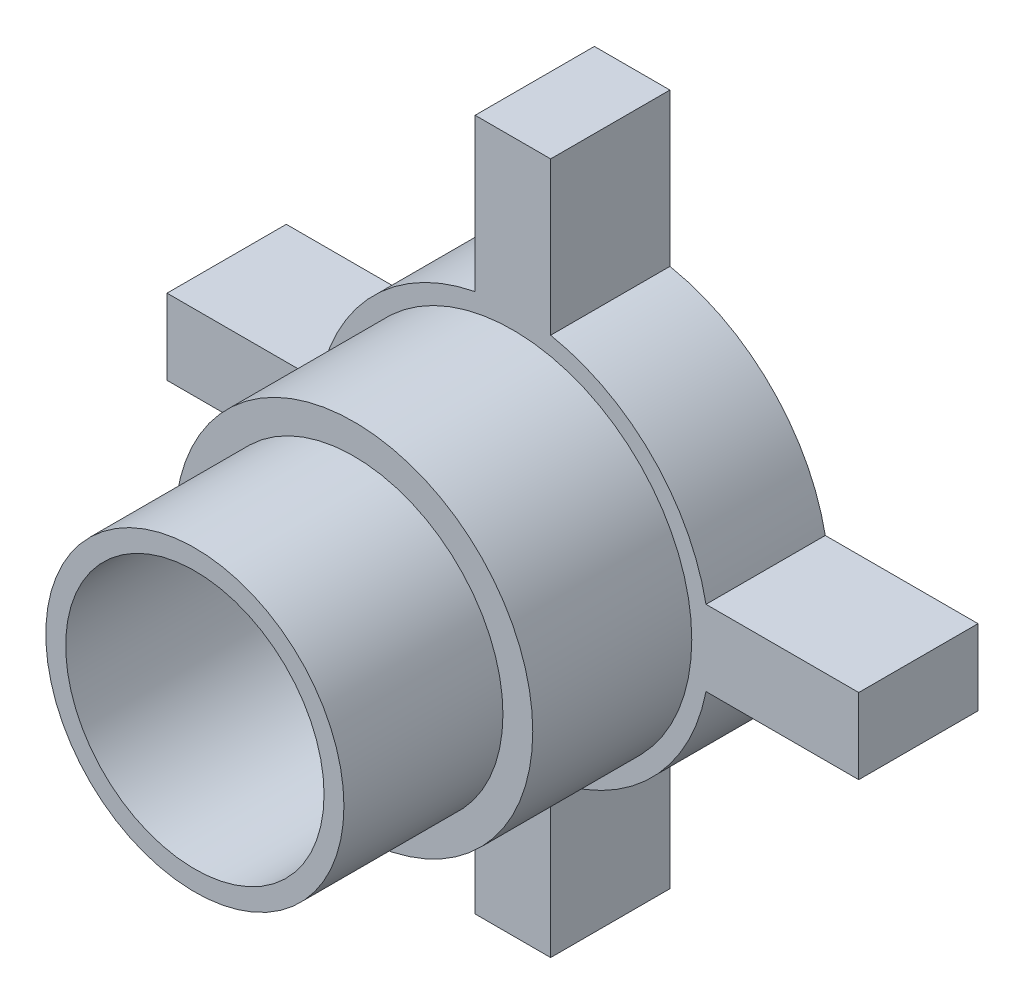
ISO-10303-21;
HEADER;
FILE_DESCRIPTION(('STEP AP214'),'2;1');
FILE_NAME('part.step','',(''),(''),'','','');
FILE_SCHEMA(('AUTOMOTIVE_DESIGN { 1 0 10303 214 1 1 1 1 }'));
ENDSEC;
DATA;
#1=APPLICATION_CONTEXT('core data for automotive mechanical design processes');
#2=APPLICATION_PROTOCOL_DEFINITION('international standard','automotive_design',2000,#1);
#3=PRODUCT_CONTEXT('',#1,'mechanical');
#4=PRODUCT('Part','Part','',(#3));
#5=PRODUCT_RELATED_PRODUCT_CATEGORY('part','',(#4));
#6=PRODUCT_DEFINITION_FORMATION('','',#4);
#7=PRODUCT_DEFINITION_CONTEXT('part definition',#1,'design');
#8=PRODUCT_DEFINITION('design','',#6,#7);
#9=PRODUCT_DEFINITION_SHAPE('','',#8);
#10=(LENGTH_UNIT() NAMED_UNIT(*) SI_UNIT(.MILLI.,.METRE.));
#11=(NAMED_UNIT(*) PLANE_ANGLE_UNIT() SI_UNIT($,.RADIAN.));
#12=(NAMED_UNIT(*) SI_UNIT($,.STERADIAN.) SOLID_ANGLE_UNIT());
#13=UNCERTAINTY_MEASURE_WITH_UNIT(LENGTH_MEASURE(1.E-05),#10,'distance_accuracy_value','');
#14=(GEOMETRIC_REPRESENTATION_CONTEXT(3) GLOBAL_UNCERTAINTY_ASSIGNED_CONTEXT((#13)) GLOBAL_UNIT_ASSIGNED_CONTEXT((#10,
#11,#12)) REPRESENTATION_CONTEXT('',''));
#15=CARTESIAN_POINT('',(0.,0.,0.));
#16=DIRECTION('',(0.,0.,1.));
#17=DIRECTION('',(1.,0.,0.));
#18=AXIS2_PLACEMENT_3D('',#15,#16,#17);
#19=CARTESIAN_POINT('',(1.9,9.7159662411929,6.));
#20=DIRECTION('',(-1.,0.,0.));
#21=DIRECTION('',(0.,0.,1.));
#22=AXIS2_PLACEMENT_3D('',#19,#20,#21);
#23=PLANE('',#22);
#24=DIRECTION('',(0.,1.,0.));
#25=VECTOR('',#24,1.);
#26=CARTESIAN_POINT('',(1.9,9.7159662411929,0.));
#27=LINE('',#26,#25);
#28=CARTESIAN_POINT('',(1.9,9.7159662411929,0.));
#29=VERTEX_POINT('',#28);
#30=CARTESIAN_POINT('',(1.9,17.4,0.));
#31=VERTEX_POINT('',#30);
#32=EDGE_CURVE('E185',#29,#31,#27,.T.);
#33=ORIENTED_EDGE('',*,*,#32,.T.);
#34=DIRECTION('',(0.,0.,-1.));
#35=VECTOR('',#34,1.);
#36=CARTESIAN_POINT('',(1.9,17.4,6.));
#37=LINE('',#36,#35);
#38=CARTESIAN_POINT('',(1.9,17.4,6.));
#39=VERTEX_POINT('',#38);
#40=EDGE_CURVE('E42',#39,#31,#37,.T.);
#41=ORIENTED_EDGE('',*,*,#40,.F.);
#42=DIRECTION('',(0.,1.,0.));
#43=VECTOR('',#42,1.);
#44=CARTESIAN_POINT('',(1.9,9.7159662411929,6.));
#45=LINE('',#44,#43);
#46=CARTESIAN_POINT('',(1.9,9.7159662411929,6.));
#47=VERTEX_POINT('',#46);
#48=EDGE_CURVE('E216',#47,#39,#45,.T.);
#49=ORIENTED_EDGE('',*,*,#48,.F.);
#50=DIRECTION('',(0.,0.,-1.));
#51=VECTOR('',#50,1.);
#52=CARTESIAN_POINT('',(1.9,9.7159662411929,6.));
#53=LINE('',#52,#51);
#54=EDGE_CURVE('E181',#47,#29,#53,.T.);
#55=ORIENTED_EDGE('',*,*,#54,.T.);
#56=EDGE_LOOP('',(#33,#41,#49,#55));
#57=FACE_BOUND('',#56,.T.);
#58=ADVANCED_FACE('F39',(#57),#23,.F.);
#59=CARTESIAN_POINT('',(-1.9,17.4,6.));
#60=DIRECTION('',(0.,-1.,0.));
#61=DIRECTION('',(0.,0.,-1.));
#62=AXIS2_PLACEMENT_3D('',#59,#60,#61);
#63=PLANE('',#62);
#64=DIRECTION('',(-1.,0.,0.));
#65=VECTOR('',#64,1.);
#66=CARTESIAN_POINT('',(-1.9,17.4,0.));
#67=LINE('',#66,#65);
#68=CARTESIAN_POINT('',(-1.9,17.4,0.));
#69=VERTEX_POINT('',#68);
#70=EDGE_CURVE('E188',#31,#69,#67,.T.);
#71=ORIENTED_EDGE('',*,*,#70,.T.);
#72=DIRECTION('',(0.,0.,-1.));
#73=VECTOR('',#72,1.);
#74=CARTESIAN_POINT('',(-1.9,17.4,6.));
#75=LINE('',#74,#73);
#76=CARTESIAN_POINT('',(-1.9,17.4,6.));
#77=VERTEX_POINT('',#76);
#78=EDGE_CURVE('E249',#77,#69,#75,.T.);
#79=ORIENTED_EDGE('',*,*,#78,.F.);
#80=DIRECTION('',(-1.,0.,0.));
#81=VECTOR('',#80,1.);
#82=CARTESIAN_POINT('',(-1.9,17.4,6.));
#83=LINE('',#82,#81);
#84=EDGE_CURVE('E124',#39,#77,#83,.T.);
#85=ORIENTED_EDGE('',*,*,#84,.F.);
#86=ORIENTED_EDGE('',*,*,#40,.T.);
#87=EDGE_LOOP('',(#71,#79,#85,#86));
#88=FACE_BOUND('',#87,.T.);
#89=ADVANCED_FACE('F255',(#88),#63,.F.);
#90=CARTESIAN_POINT('',(-1.9,9.7159662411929,6.));
#91=DIRECTION('',(1.,0.,0.));
#92=DIRECTION('',(0.,0.,-1.));
#93=AXIS2_PLACEMENT_3D('',#90,#91,#92);
#94=PLANE('',#93);
#95=DIRECTION('',(0.,-1.,0.));
#96=VECTOR('',#95,1.);
#97=CARTESIAN_POINT('',(-1.9,9.7159662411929,0.));
#98=LINE('',#97,#96);
#99=CARTESIAN_POINT('',(-1.9,9.7159662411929,0.));
#100=VERTEX_POINT('',#99);
#101=EDGE_CURVE('E191',#69,#100,#98,.T.);
#102=ORIENTED_EDGE('',*,*,#101,.T.);
#103=DIRECTION('',(0.,0.,-1.));
#104=VECTOR('',#103,1.);
#105=CARTESIAN_POINT('',(-1.9,9.7159662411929,6.));
#106=LINE('',#105,#104);
#107=CARTESIAN_POINT('',(-1.9,9.7159662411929,6.));
#108=VERTEX_POINT('',#107);
#109=EDGE_CURVE('E247',#108,#100,#106,.T.);
#110=ORIENTED_EDGE('',*,*,#109,.F.);
#111=DIRECTION('',(0.,-1.,0.));
#112=VECTOR('',#111,1.);
#113=CARTESIAN_POINT('',(-1.9,9.7159662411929,6.));
#114=LINE('',#113,#112);
#115=EDGE_CURVE('E272',#77,#108,#114,.T.);
#116=ORIENTED_EDGE('',*,*,#115,.F.);
#117=ORIENTED_EDGE('',*,*,#78,.T.);
#118=EDGE_LOOP('',(#102,#110,#116,#117));
#119=FACE_BOUND('',#118,.T.);
#120=ADVANCED_FACE('F264',(#119),#94,.F.);
#121=CARTESIAN_POINT('',(0.,0.,6.));
#122=DIRECTION('',(0.,0.,-1.));
#123=DIRECTION('',(-1.,0.,0.));
#124=AXIS2_PLACEMENT_3D('',#121,#122,#123);
#125=CYLINDRICAL_SURFACE('',#124,9.9);
#126=CARTESIAN_POINT('',(0.,0.,0.));
#127=DIRECTION('',(0.,0.,1.));
#128=DIRECTION('',(1.,0.,0.));
#129=AXIS2_PLACEMENT_3D('',#126,#127,#128);
#130=CIRCLE('',#129,9.9);
#131=CARTESIAN_POINT('',(-9.7159662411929,1.9,0.));
#132=VERTEX_POINT('',#131);
#133=EDGE_CURVE('E193',#100,#132,#130,.T.);
#134=ORIENTED_EDGE('',*,*,#133,.T.);
#135=DIRECTION('',(0.,0.,-1.));
#136=VECTOR('',#135,1.);
#137=CARTESIAN_POINT('',(-9.7159662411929,1.9,6.));
#138=LINE('',#137,#136);
#139=CARTESIAN_POINT('',(-9.7159662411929,1.9,6.));
#140=VERTEX_POINT('',#139);
#141=EDGE_CURVE('E244',#140,#132,#138,.T.);
#142=ORIENTED_EDGE('',*,*,#141,.F.);
#143=CARTESIAN_POINT('',(0.,0.,6.));
#144=DIRECTION('',(0.,0.,1.));
#145=DIRECTION('',(1.,0.,0.));
#146=AXIS2_PLACEMENT_3D('',#143,#144,#145);
#147=CIRCLE('',#146,9.9);
#148=EDGE_CURVE('E269',#108,#140,#147,.T.);
#149=ORIENTED_EDGE('',*,*,#148,.F.);
#150=ORIENTED_EDGE('',*,*,#109,.T.);
#151=EDGE_LOOP('',(#134,#142,#149,#150));
#152=FACE_BOUND('',#151,.T.);
#153=ADVANCED_FACE('F267',(#152),#125,.T.);
#154=CARTESIAN_POINT('',(-17.4,1.9,6.));
#155=DIRECTION('',(0.,-1.,0.));
#156=DIRECTION('',(1.,0.,0.));
#157=AXIS2_PLACEMENT_3D('',#154,#155,#156);
#158=PLANE('',#157);
#159=DIRECTION('',(-1.,0.,0.));
#160=VECTOR('',#159,1.);
#161=CARTESIAN_POINT('',(-17.4,1.9,0.));
#162=LINE('',#161,#160);
#163=CARTESIAN_POINT('',(-17.4,1.9,0.));
#164=VERTEX_POINT('',#163);
#165=EDGE_CURVE('E195',#132,#164,#162,.T.);
#166=ORIENTED_EDGE('',*,*,#165,.T.);
#167=DIRECTION('',(0.,0.,-1.));
#168=VECTOR('',#167,1.);
#169=CARTESIAN_POINT('',(-17.4,1.9,6.));
#170=LINE('',#169,#168);
#171=CARTESIAN_POINT('',(-17.4,1.9,6.));
#172=VERTEX_POINT('',#171);
#173=EDGE_CURVE('E241',#172,#164,#170,.T.);
#174=ORIENTED_EDGE('',*,*,#173,.F.);
#175=DIRECTION('',(-1.,0.,0.));
#176=VECTOR('',#175,1.);
#177=CARTESIAN_POINT('',(-17.4,1.9,6.));
#178=LINE('',#177,#176);
#179=EDGE_CURVE('E271',#140,#172,#178,.T.);
#180=ORIENTED_EDGE('',*,*,#179,.F.);
#181=ORIENTED_EDGE('',*,*,#141,.T.);
#182=EDGE_LOOP('',(#166,#174,#180,#181));
#183=FACE_BOUND('',#182,.T.);
#184=ADVANCED_FACE('F331',(#183),#158,.F.);
#185=CARTESIAN_POINT('',(-17.4,1.9,6.));
#186=DIRECTION('',(1.,0.,0.));
#187=DIRECTION('',(0.,0.,-1.));
#188=AXIS2_PLACEMENT_3D('',#185,#186,#187);
#189=PLANE('',#188);
#190=DIRECTION('',(0.,-1.,0.));
#191=VECTOR('',#190,1.);
#192=CARTESIAN_POINT('',(-17.4,1.9,0.));
#193=LINE('',#192,#191);
#194=CARTESIAN_POINT('',(-17.4,-1.9,0.));
#195=VERTEX_POINT('',#194);
#196=EDGE_CURVE('E197',#164,#195,#193,.T.);
#197=ORIENTED_EDGE('',*,*,#196,.T.);
#198=DIRECTION('',(0.,0.,-1.));
#199=VECTOR('',#198,1.);
#200=CARTESIAN_POINT('',(-17.4,-1.9,6.));
#201=LINE('',#200,#199);
#202=CARTESIAN_POINT('',(-17.4,-1.9,6.));
#203=VERTEX_POINT('',#202);
#204=EDGE_CURVE('E238',#203,#195,#201,.T.);
#205=ORIENTED_EDGE('',*,*,#204,.F.);
#206=DIRECTION('',(0.,-1.,0.));
#207=VECTOR('',#206,1.);
#208=CARTESIAN_POINT('',(-17.4,1.9,6.));
#209=LINE('',#208,#207);
#210=EDGE_CURVE('E274',#172,#203,#209,.T.);
#211=ORIENTED_EDGE('',*,*,#210,.F.);
#212=ORIENTED_EDGE('',*,*,#173,.T.);
#213=EDGE_LOOP('',(#197,#205,#211,#212));
#214=FACE_BOUND('',#213,.T.);
#215=ADVANCED_FACE('F328',(#214),#189,.F.);
#216=CARTESIAN_POINT('',(-17.4,-1.9,6.));
#217=DIRECTION('',(0.,1.,0.));
#218=DIRECTION('',(-1.,0.,0.));
#219=AXIS2_PLACEMENT_3D('',#216,#217,#218);
#220=PLANE('',#219);
#221=DIRECTION('',(1.,0.,0.));
#222=VECTOR('',#221,1.);
#223=CARTESIAN_POINT('',(-17.4,-1.9,0.));
#224=LINE('',#223,#222);
#225=CARTESIAN_POINT('',(-9.7159662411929,-1.9,0.));
#226=VERTEX_POINT('',#225);
#227=EDGE_CURVE('E199',#195,#226,#224,.T.);
#228=ORIENTED_EDGE('',*,*,#227,.T.);
#229=DIRECTION('',(0.,0.,-1.));
#230=VECTOR('',#229,1.);
#231=CARTESIAN_POINT('',(-9.7159662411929,-1.9,6.));
#232=LINE('',#231,#230);
#233=CARTESIAN_POINT('',(-9.7159662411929,-1.9,6.));
#234=VERTEX_POINT('',#233);
#235=EDGE_CURVE('E235',#234,#226,#232,.T.);
#236=ORIENTED_EDGE('',*,*,#235,.F.);
#237=DIRECTION('',(1.,0.,0.));
#238=VECTOR('',#237,1.);
#239=CARTESIAN_POINT('',(-17.4,-1.9,6.));
#240=LINE('',#239,#238);
#241=EDGE_CURVE('E280',#203,#234,#240,.T.);
#242=ORIENTED_EDGE('',*,*,#241,.F.);
#243=ORIENTED_EDGE('',*,*,#204,.T.);
#244=EDGE_LOOP('',(#228,#236,#242,#243));
#245=FACE_BOUND('',#244,.T.);
#246=ADVANCED_FACE('F324',(#245),#220,.F.);
#247=CARTESIAN_POINT('',(0.,0.,6.));
#248=DIRECTION('',(0.,0.,-1.));
#249=DIRECTION('',(-1.,0.,0.));
#250=AXIS2_PLACEMENT_3D('',#247,#248,#249);
#251=CYLINDRICAL_SURFACE('',#250,9.9);
#252=CARTESIAN_POINT('',(0.,0.,0.));
#253=DIRECTION('',(0.,0.,1.));
#254=DIRECTION('',(1.,0.,0.));
#255=AXIS2_PLACEMENT_3D('',#252,#253,#254);
#256=CIRCLE('',#255,9.9);
#257=CARTESIAN_POINT('',(-1.90000000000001,-9.71596624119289,0.));
#258=VERTEX_POINT('',#257);
#259=EDGE_CURVE('E201',#226,#258,#256,.T.);
#260=ORIENTED_EDGE('',*,*,#259,.T.);
#261=DIRECTION('',(0.,0.,-1.));
#262=VECTOR('',#261,1.);
#263=CARTESIAN_POINT('',(-1.90000000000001,-9.71596624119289,6.));
#264=LINE('',#263,#262);
#265=CARTESIAN_POINT('',(-1.90000000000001,-9.71596624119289,6.));
#266=VERTEX_POINT('',#265);
#267=EDGE_CURVE('E232',#266,#258,#264,.T.);
#268=ORIENTED_EDGE('',*,*,#267,.F.);
#269=CARTESIAN_POINT('',(0.,0.,6.));
#270=DIRECTION('',(0.,0.,1.));
#271=DIRECTION('',(1.,0.,0.));
#272=AXIS2_PLACEMENT_3D('',#269,#270,#271);
#273=CIRCLE('',#272,9.9);
#274=EDGE_CURVE('E282',#234,#266,#273,.T.);
#275=ORIENTED_EDGE('',*,*,#274,.F.);
#276=ORIENTED_EDGE('',*,*,#235,.T.);
#277=EDGE_LOOP('',(#260,#268,#275,#276));
#278=FACE_BOUND('',#277,.T.);
#279=ADVANCED_FACE('F319',(#278),#251,.T.);
#280=CARTESIAN_POINT('',(-1.9,-17.4,6.));
#281=DIRECTION('',(1.,0.,0.));
#282=DIRECTION('',(0.,1.,0.));
#283=AXIS2_PLACEMENT_3D('',#280,#281,#282);
#284=PLANE('',#283);
#285=DIRECTION('',(0.,-1.,0.));
#286=VECTOR('',#285,1.);
#287=CARTESIAN_POINT('',(-1.9,-17.4,0.));
#288=LINE('',#287,#286);
#289=CARTESIAN_POINT('',(-1.9,-17.4,0.));
#290=VERTEX_POINT('',#289);
#291=EDGE_CURVE('E203',#258,#290,#288,.T.);
#292=ORIENTED_EDGE('',*,*,#291,.T.);
#293=DIRECTION('',(0.,0.,-1.));
#294=VECTOR('',#293,1.);
#295=CARTESIAN_POINT('',(-1.9,-17.4,6.));
#296=LINE('',#295,#294);
#297=CARTESIAN_POINT('',(-1.9,-17.4,6.));
#298=VERTEX_POINT('',#297);
#299=EDGE_CURVE('E229',#298,#290,#296,.T.);
#300=ORIENTED_EDGE('',*,*,#299,.F.);
#301=DIRECTION('',(0.,-1.,0.));
#302=VECTOR('',#301,1.);
#303=CARTESIAN_POINT('',(-1.9,-17.4,6.));
#304=LINE('',#303,#302);
#305=EDGE_CURVE('E284',#266,#298,#304,.T.);
#306=ORIENTED_EDGE('',*,*,#305,.F.);
#307=ORIENTED_EDGE('',*,*,#267,.T.);
#308=EDGE_LOOP('',(#292,#300,#306,#307));
#309=FACE_BOUND('',#308,.T.);
#310=ADVANCED_FACE('F313',(#309),#284,.F.);
#311=CARTESIAN_POINT('',(-1.9,-17.4,6.));
#312=DIRECTION('',(0.,1.,0.));
#313=DIRECTION('',(0.,0.,1.));
#314=AXIS2_PLACEMENT_3D('',#311,#312,#313);
#315=PLANE('',#314);
#316=DIRECTION('',(1.,0.,0.));
#317=VECTOR('',#316,1.);
#318=CARTESIAN_POINT('',(-1.9,-17.4,0.));
#319=LINE('',#318,#317);
#320=CARTESIAN_POINT('',(1.9,-17.4,0.));
#321=VERTEX_POINT('',#320);
#322=EDGE_CURVE('E205',#290,#321,#319,.T.);
#323=ORIENTED_EDGE('',*,*,#322,.T.);
#324=DIRECTION('',(0.,0.,-1.));
#325=VECTOR('',#324,1.);
#326=CARTESIAN_POINT('',(1.9,-17.4,6.));
#327=LINE('',#326,#325);
#328=CARTESIAN_POINT('',(1.9,-17.4,6.));
#329=VERTEX_POINT('',#328);
#330=EDGE_CURVE('E226',#329,#321,#327,.T.);
#331=ORIENTED_EDGE('',*,*,#330,.F.);
#332=DIRECTION('',(1.,0.,0.));
#333=VECTOR('',#332,1.);
#334=CARTESIAN_POINT('',(-1.9,-17.4,6.));
#335=LINE('',#334,#333);
#336=EDGE_CURVE('E286',#298,#329,#335,.T.);
#337=ORIENTED_EDGE('',*,*,#336,.F.);
#338=ORIENTED_EDGE('',*,*,#299,.T.);
#339=EDGE_LOOP('',(#323,#331,#337,#338));
#340=FACE_BOUND('',#339,.T.);
#341=ADVANCED_FACE('F309',(#340),#315,.F.);
#342=CARTESIAN_POINT('',(1.9,-17.4,6.));
#343=DIRECTION('',(-1.,0.,0.));
#344=DIRECTION('',(0.,-1.,0.));
#345=AXIS2_PLACEMENT_3D('',#342,#343,#344);
#346=PLANE('',#345);
#347=DIRECTION('',(0.,1.,0.));
#348=VECTOR('',#347,1.);
#349=CARTESIAN_POINT('',(1.9,-17.4,0.));
#350=LINE('',#349,#348);
#351=CARTESIAN_POINT('',(1.9,-9.7159662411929,0.));
#352=VERTEX_POINT('',#351);
#353=EDGE_CURVE('E207',#321,#352,#350,.T.);
#354=ORIENTED_EDGE('',*,*,#353,.T.);
#355=DIRECTION('',(0.,0.,-1.));
#356=VECTOR('',#355,1.);
#357=CARTESIAN_POINT('',(1.9,-9.7159662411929,6.));
#358=LINE('',#357,#356);
#359=CARTESIAN_POINT('',(1.9,-9.7159662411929,6.));
#360=VERTEX_POINT('',#359);
#361=EDGE_CURVE('E223',#360,#352,#358,.T.);
#362=ORIENTED_EDGE('',*,*,#361,.F.);
#363=DIRECTION('',(0.,1.,0.));
#364=VECTOR('',#363,1.);
#365=CARTESIAN_POINT('',(1.9,-17.4,6.));
#366=LINE('',#365,#364);
#367=EDGE_CURVE('E288',#329,#360,#366,.T.);
#368=ORIENTED_EDGE('',*,*,#367,.F.);
#369=ORIENTED_EDGE('',*,*,#330,.T.);
#370=EDGE_LOOP('',(#354,#362,#368,#369));
#371=FACE_BOUND('',#370,.T.);
#372=ADVANCED_FACE('F305',(#371),#346,.F.);
#373=CARTESIAN_POINT('',(0.,0.,6.));
#374=DIRECTION('',(0.,0.,-1.));
#375=DIRECTION('',(-1.,0.,0.));
#376=AXIS2_PLACEMENT_3D('',#373,#374,#375);
#377=CYLINDRICAL_SURFACE('',#376,9.9);
#378=CARTESIAN_POINT('',(0.,0.,0.));
#379=DIRECTION('',(0.,0.,1.));
#380=DIRECTION('',(1.,0.,0.));
#381=AXIS2_PLACEMENT_3D('',#378,#379,#380);
#382=CIRCLE('',#381,9.9);
#383=CARTESIAN_POINT('',(9.7159662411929,-1.9,0.));
#384=VERTEX_POINT('',#383);
#385=EDGE_CURVE('E209',#352,#384,#382,.T.);
#386=ORIENTED_EDGE('',*,*,#385,.T.);
#387=DIRECTION('',(0.,0.,-1.));
#388=VECTOR('',#387,1.);
#389=CARTESIAN_POINT('',(9.7159662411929,-1.9,6.));
#390=LINE('',#389,#388);
#391=CARTESIAN_POINT('',(9.7159662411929,-1.9,6.));
#392=VERTEX_POINT('',#391);
#393=EDGE_CURVE('E220',#392,#384,#390,.T.);
#394=ORIENTED_EDGE('',*,*,#393,.F.);
#395=CARTESIAN_POINT('',(0.,0.,6.));
#396=DIRECTION('',(0.,0.,1.));
#397=DIRECTION('',(1.,0.,0.));
#398=AXIS2_PLACEMENT_3D('',#395,#396,#397);
#399=CIRCLE('',#398,9.9);
#400=EDGE_CURVE('E290',#360,#392,#399,.T.);
#401=ORIENTED_EDGE('',*,*,#400,.F.);
#402=ORIENTED_EDGE('',*,*,#361,.T.);
#403=EDGE_LOOP('',(#386,#394,#401,#402));
#404=FACE_BOUND('',#403,.T.);
#405=ADVANCED_FACE('F296',(#404),#377,.T.);
#406=CARTESIAN_POINT('',(9.7159662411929,-1.9,6.));
#407=DIRECTION('',(0.,1.,0.));
#408=DIRECTION('',(0.,0.,1.));
#409=AXIS2_PLACEMENT_3D('',#406,#407,#408);
#410=PLANE('',#409);
#411=DIRECTION('',(1.,0.,0.));
#412=VECTOR('',#411,1.);
#413=CARTESIAN_POINT('',(9.7159662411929,-1.9,0.));
#414=LINE('',#413,#412);
#415=CARTESIAN_POINT('',(17.4,-1.9,0.));
#416=VERTEX_POINT('',#415);
#417=EDGE_CURVE('E211',#384,#416,#414,.T.);
#418=ORIENTED_EDGE('',*,*,#417,.T.);
#419=DIRECTION('',(0.,0.,-1.));
#420=VECTOR('',#419,1.);
#421=CARTESIAN_POINT('',(17.4,-1.9,6.));
#422=LINE('',#421,#420);
#423=CARTESIAN_POINT('',(17.4,-1.9,6.));
#424=VERTEX_POINT('',#423);
#425=EDGE_CURVE('E176',#424,#416,#422,.T.);
#426=ORIENTED_EDGE('',*,*,#425,.F.);
#427=DIRECTION('',(1.,0.,0.));
#428=VECTOR('',#427,1.);
#429=CARTESIAN_POINT('',(9.7159662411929,-1.9,6.));
#430=LINE('',#429,#428);
#431=EDGE_CURVE('E167',#392,#424,#430,.T.);
#432=ORIENTED_EDGE('',*,*,#431,.F.);
#433=ORIENTED_EDGE('',*,*,#393,.T.);
#434=EDGE_LOOP('',(#418,#426,#432,#433));
#435=FACE_BOUND('',#434,.T.);
#436=ADVANCED_FACE('F300',(#435),#410,.F.);
#437=CARTESIAN_POINT('',(17.4,1.9,6.));
#438=DIRECTION('',(-1.,0.,0.));
#439=DIRECTION('',(0.,0.,1.));
#440=AXIS2_PLACEMENT_3D('',#437,#438,#439);
#441=PLANE('',#440);
#442=DIRECTION('',(0.,1.,0.));
#443=VECTOR('',#442,1.);
#444=CARTESIAN_POINT('',(17.4,1.9,0.));
#445=LINE('',#444,#443);
#446=CARTESIAN_POINT('',(17.4,1.9,0.));
#447=VERTEX_POINT('',#446);
#448=EDGE_CURVE('E175',#416,#447,#445,.T.);
#449=ORIENTED_EDGE('',*,*,#448,.T.);
#450=DIRECTION('',(0.,0.,-1.));
#451=VECTOR('',#450,1.);
#452=CARTESIAN_POINT('',(17.4,1.9,6.));
#453=LINE('',#452,#451);
#454=CARTESIAN_POINT('',(17.4,1.9,6.));
#455=VERTEX_POINT('',#454);
#456=EDGE_CURVE('E172',#455,#447,#453,.T.);
#457=ORIENTED_EDGE('',*,*,#456,.F.);
#458=DIRECTION('',(0.,1.,0.));
#459=VECTOR('',#458,1.);
#460=CARTESIAN_POINT('',(17.4,1.9,6.));
#461=LINE('',#460,#459);
#462=EDGE_CURVE('E161',#424,#455,#461,.T.);
#463=ORIENTED_EDGE('',*,*,#462,.F.);
#464=ORIENTED_EDGE('',*,*,#425,.T.);
#465=EDGE_LOOP('',(#449,#457,#463,#464));
#466=FACE_BOUND('',#465,.T.);
#467=ADVANCED_FACE('F173',(#466),#441,.F.);
#468=CARTESIAN_POINT('',(9.7159662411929,1.9,6.));
#469=DIRECTION('',(0.,-1.,0.));
#470=DIRECTION('',(0.,0.,-1.));
#471=AXIS2_PLACEMENT_3D('',#468,#469,#470);
#472=PLANE('',#471);
#473=DIRECTION('',(-1.,0.,0.));
#474=VECTOR('',#473,1.);
#475=CARTESIAN_POINT('',(9.7159662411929,1.9,0.));
#476=LINE('',#475,#474);
#477=CARTESIAN_POINT('',(9.7159662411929,1.9,0.));
#478=VERTEX_POINT('',#477);
#479=EDGE_CURVE('E109',#447,#478,#476,.T.);
#480=ORIENTED_EDGE('',*,*,#479,.T.);
#481=DIRECTION('',(0.,0.,-1.));
#482=VECTOR('',#481,1.);
#483=CARTESIAN_POINT('',(9.7159662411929,1.9,6.));
#484=LINE('',#483,#482);
#485=CARTESIAN_POINT('',(9.7159662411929,1.9,6.));
#486=VERTEX_POINT('',#485);
#487=EDGE_CURVE('E177',#486,#478,#484,.T.);
#488=ORIENTED_EDGE('',*,*,#487,.F.);
#489=DIRECTION('',(-1.,0.,0.));
#490=VECTOR('',#489,1.);
#491=CARTESIAN_POINT('',(9.7159662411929,1.9,6.));
#492=LINE('',#491,#490);
#493=EDGE_CURVE('E165',#455,#486,#492,.T.);
#494=ORIENTED_EDGE('',*,*,#493,.F.);
#495=ORIENTED_EDGE('',*,*,#456,.T.);
#496=EDGE_LOOP('',(#480,#488,#494,#495));
#497=FACE_BOUND('',#496,.T.);
#498=ADVANCED_FACE('F179',(#497),#472,.F.);
#499=CARTESIAN_POINT('',(0.,0.,6.));
#500=DIRECTION('',(0.,0.,-1.));
#501=DIRECTION('',(-1.,0.,0.));
#502=AXIS2_PLACEMENT_3D('',#499,#500,#501);
#503=CYLINDRICAL_SURFACE('',#502,9.9);
#504=CARTESIAN_POINT('',(0.,0.,0.));
#505=DIRECTION('',(0.,0.,1.));
#506=DIRECTION('',(1.,0.,0.));
#507=AXIS2_PLACEMENT_3D('',#504,#505,#506);
#508=CIRCLE('',#507,9.9);
#509=EDGE_CURVE('E115',#478,#29,#508,.T.);
#510=ORIENTED_EDGE('',*,*,#509,.T.);
#511=ORIENTED_EDGE('',*,*,#54,.F.);
#512=CARTESIAN_POINT('',(0.,0.,6.));
#513=DIRECTION('',(0.,0.,1.));
#514=DIRECTION('',(1.,0.,0.));
#515=AXIS2_PLACEMENT_3D('',#512,#513,#514);
#516=CIRCLE('',#515,9.9);
#517=EDGE_CURVE('E56',#486,#47,#516,.T.);
#518=ORIENTED_EDGE('',*,*,#517,.F.);
#519=ORIENTED_EDGE('',*,*,#487,.T.);
#520=EDGE_LOOP('',(#510,#511,#518,#519));
#521=FACE_BOUND('',#520,.T.);
#522=ADVANCED_FACE('F448',(#521),#503,.T.);
#523=CARTESIAN_POINT('',(0.,0.,6.));
#524=DIRECTION('',(0.,0.,1.));
#525=DIRECTION('',(1.,0.,0.));
#526=AXIS2_PLACEMENT_3D('',#523,#524,#525);
#527=PLANE('',#526);
#528=CARTESIAN_POINT('',(0.,0.,6.));
#529=DIRECTION('',(0.,0.,1.));
#530=DIRECTION('',(1.,0.,0.));
#531=AXIS2_PLACEMENT_3D('',#528,#529,#530);
#532=CIRCLE('',#531,9.);
#533=CARTESIAN_POINT('',(9.,0.,6.));
#534=VERTEX_POINT('',#533);
#535=EDGE_CURVE('E585',#534,#534,#532,.T.);
#536=ORIENTED_EDGE('',*,*,#535,.F.);
#537=EDGE_LOOP('',(#536));
#538=FACE_BOUND('',#537,.T.);
#539=ORIENTED_EDGE('',*,*,#48,.T.);
#540=ORIENTED_EDGE('',*,*,#84,.T.);
#541=ORIENTED_EDGE('',*,*,#115,.T.);
#542=ORIENTED_EDGE('',*,*,#148,.T.);
#543=ORIENTED_EDGE('',*,*,#179,.T.);
#544=ORIENTED_EDGE('',*,*,#210,.T.);
#545=ORIENTED_EDGE('',*,*,#241,.T.);
#546=ORIENTED_EDGE('',*,*,#274,.T.);
#547=ORIENTED_EDGE('',*,*,#305,.T.);
#548=ORIENTED_EDGE('',*,*,#336,.T.);
#549=ORIENTED_EDGE('',*,*,#367,.T.);
#550=ORIENTED_EDGE('',*,*,#400,.T.);
#551=ORIENTED_EDGE('',*,*,#431,.T.);
#552=ORIENTED_EDGE('',*,*,#462,.T.);
#553=ORIENTED_EDGE('',*,*,#493,.T.);
#554=ORIENTED_EDGE('',*,*,#517,.T.);
#555=EDGE_LOOP('',(#539,#540,#541,#542,#543,#544,#545,#546,#547,#548,#549,#550,#551,#552,#553,#554));
#556=FACE_BOUND('',#555,.T.);
#557=ADVANCED_FACE('F163',(#538,#556),#527,.T.);
#558=CARTESIAN_POINT('',(0.,0.,0.));
#559=DIRECTION('',(0.,0.,1.));
#560=DIRECTION('',(1.,0.,0.));
#561=AXIS2_PLACEMENT_3D('',#558,#559,#560);
#562=PLANE('',#561);
#563=CARTESIAN_POINT('',(0.,0.,0.));
#564=DIRECTION('',(0.,0.,1.));
#565=DIRECTION('',(1.,0.,0.));
#566=AXIS2_PLACEMENT_3D('',#563,#564,#565);
#567=CIRCLE('',#566,6.5);
#568=CARTESIAN_POINT('',(6.5,0.,0.));
#569=VERTEX_POINT('',#568);
#570=EDGE_CURVE('E576',#569,#569,#567,.T.);
#571=ORIENTED_EDGE('',*,*,#570,.T.);
#572=EDGE_LOOP('',(#571));
#573=FACE_BOUND('',#572,.T.);
#574=ORIENTED_EDGE('',*,*,#32,.F.);
#575=ORIENTED_EDGE('',*,*,#509,.F.);
#576=ORIENTED_EDGE('',*,*,#479,.F.);
#577=ORIENTED_EDGE('',*,*,#448,.F.);
#578=ORIENTED_EDGE('',*,*,#417,.F.);
#579=ORIENTED_EDGE('',*,*,#385,.F.);
#580=ORIENTED_EDGE('',*,*,#353,.F.);
#581=ORIENTED_EDGE('',*,*,#322,.F.);
#582=ORIENTED_EDGE('',*,*,#291,.F.);
#583=ORIENTED_EDGE('',*,*,#259,.F.);
#584=ORIENTED_EDGE('',*,*,#227,.F.);
#585=ORIENTED_EDGE('',*,*,#196,.F.);
#586=ORIENTED_EDGE('',*,*,#165,.F.);
#587=ORIENTED_EDGE('',*,*,#133,.F.);
#588=ORIENTED_EDGE('',*,*,#101,.F.);
#589=ORIENTED_EDGE('',*,*,#70,.F.);
#590=EDGE_LOOP('',(#574,#575,#576,#577,#578,#579,#580,#581,#582,#583,#584,#585,#586,#587,#588,#589));
#591=FACE_BOUND('',#590,.T.);
#592=ADVANCED_FACE('F260',(#573,#591),#562,.F.);
#593=CARTESIAN_POINT('',(0.,0.,14.));
#594=DIRECTION('',(0.,0.,-1.));
#595=DIRECTION('',(-1.,0.,0.));
#596=AXIS2_PLACEMENT_3D('',#593,#594,#595);
#597=CYLINDRICAL_SURFACE('',#596,9.);
#598=CARTESIAN_POINT('',(0.,0.,14.));
#599=DIRECTION('',(0.,0.,1.));
#600=DIRECTION('',(1.,0.,0.));
#601=AXIS2_PLACEMENT_3D('',#598,#599,#600);
#602=CIRCLE('',#601,9.);
#603=CARTESIAN_POINT('',(9.,0.,14.));
#604=VERTEX_POINT('',#603);
#605=EDGE_CURVE('E189',#604,#604,#602,.T.);
#606=ORIENTED_EDGE('',*,*,#605,.F.);
#607=EDGE_LOOP('',(#606));
#608=FACE_BOUND('',#607,.T.);
#609=ORIENTED_EDGE('',*,*,#535,.T.);
#610=EDGE_LOOP('',(#609));
#611=FACE_BOUND('',#610,.T.);
#612=ADVANCED_FACE('F475',(#608,#611),#597,.T.);
#613=CARTESIAN_POINT('',(0.,0.,14.));
#614=DIRECTION('',(0.,0.,1.));
#615=DIRECTION('',(1.,0.,0.));
#616=AXIS2_PLACEMENT_3D('',#613,#614,#615);
#617=PLANE('',#616);
#618=CARTESIAN_POINT('',(0.,0.,14.));
#619=DIRECTION('',(0.,0.,1.));
#620=DIRECTION('',(1.,0.,0.));
#621=AXIS2_PLACEMENT_3D('',#618,#619,#620);
#622=CIRCLE('',#621,7.5);
#623=CARTESIAN_POINT('',(7.5,0.,14.));
#624=VERTEX_POINT('',#623);
#625=EDGE_CURVE('E11',#624,#624,#622,.T.);
#626=ORIENTED_EDGE('',*,*,#625,.F.);
#627=EDGE_LOOP('',(#626));
#628=FACE_BOUND('',#627,.T.);
#629=ORIENTED_EDGE('',*,*,#605,.T.);
#630=EDGE_LOOP('',(#629));
#631=FACE_BOUND('',#630,.T.);
#632=ADVANCED_FACE('F480',(#628,#631),#617,.T.);
#633=CARTESIAN_POINT('',(0.,0.,22.));
#634=DIRECTION('',(0.,0.,-1.));
#635=DIRECTION('',(-1.,0.,0.));
#636=AXIS2_PLACEMENT_3D('',#633,#634,#635);
#637=CYLINDRICAL_SURFACE('',#636,7.5);
#638=CARTESIAN_POINT('',(0.,0.,22.));
#639=DIRECTION('',(0.,0.,1.));
#640=DIRECTION('',(1.,0.,0.));
#641=AXIS2_PLACEMENT_3D('',#638,#639,#640);
#642=CIRCLE('',#641,7.5);
#643=CARTESIAN_POINT('',(7.5,0.,22.));
#644=VERTEX_POINT('',#643);
#645=EDGE_CURVE('E581',#644,#644,#642,.T.);
#646=ORIENTED_EDGE('',*,*,#645,.F.);
#647=EDGE_LOOP('',(#646));
#648=FACE_BOUND('',#647,.T.);
#649=ORIENTED_EDGE('',*,*,#625,.T.);
#650=EDGE_LOOP('',(#649));
#651=FACE_BOUND('',#650,.T.);
#652=ADVANCED_FACE('F491',(#648,#651),#637,.T.);
#653=CARTESIAN_POINT('',(0.,0.,22.));
#654=DIRECTION('',(0.,0.,1.));
#655=DIRECTION('',(1.,0.,0.));
#656=AXIS2_PLACEMENT_3D('',#653,#654,#655);
#657=PLANE('',#656);
#658=CARTESIAN_POINT('',(0.,0.,22.));
#659=DIRECTION('',(0.,0.,1.));
#660=DIRECTION('',(1.,0.,0.));
#661=AXIS2_PLACEMENT_3D('',#658,#659,#660);
#662=CIRCLE('',#661,6.5);
#663=CARTESIAN_POINT('',(6.5,0.,22.));
#664=VERTEX_POINT('',#663);
#665=EDGE_CURVE('E579',#664,#664,#662,.T.);
#666=ORIENTED_EDGE('',*,*,#665,.F.);
#667=EDGE_LOOP('',(#666));
#668=FACE_BOUND('',#667,.T.);
#669=ORIENTED_EDGE('',*,*,#645,.T.);
#670=EDGE_LOOP('',(#669));
#671=FACE_BOUND('',#670,.T.);
#672=ADVANCED_FACE('F502',(#668,#671),#657,.T.);
#673=CARTESIAN_POINT('',(0.,0.,0.));
#674=DIRECTION('',(0.,0.,1.));
#675=DIRECTION('',(1.,0.,0.));
#676=AXIS2_PLACEMENT_3D('',#673,#674,#675);
#677=CYLINDRICAL_SURFACE('',#676,6.5);
#678=ORIENTED_EDGE('',*,*,#570,.F.);
#679=EDGE_LOOP('',(#678));
#680=FACE_BOUND('',#679,.T.);
#681=ORIENTED_EDGE('',*,*,#665,.T.);
#682=EDGE_LOOP('',(#681));
#683=FACE_BOUND('',#682,.T.);
#684=ADVANCED_FACE('F518',(#680,#683),#677,.F.);
#685=CLOSED_SHELL('',(#58,#89,#120,#153,#184,#215,#246,#279,#310,#341,#372,#405,#436,#467,#498,
#522,#557,#592,#612,#632,#652,#672,#684));
#686=MANIFOLD_SOLID_BREP('B2',#685);
#687=ADVANCED_BREP_SHAPE_REPRESENTATION('',(#18,#686),#14);
#688=SHAPE_DEFINITION_REPRESENTATION(#9,#687);
ENDSEC;
END-ISO-10303-21;
